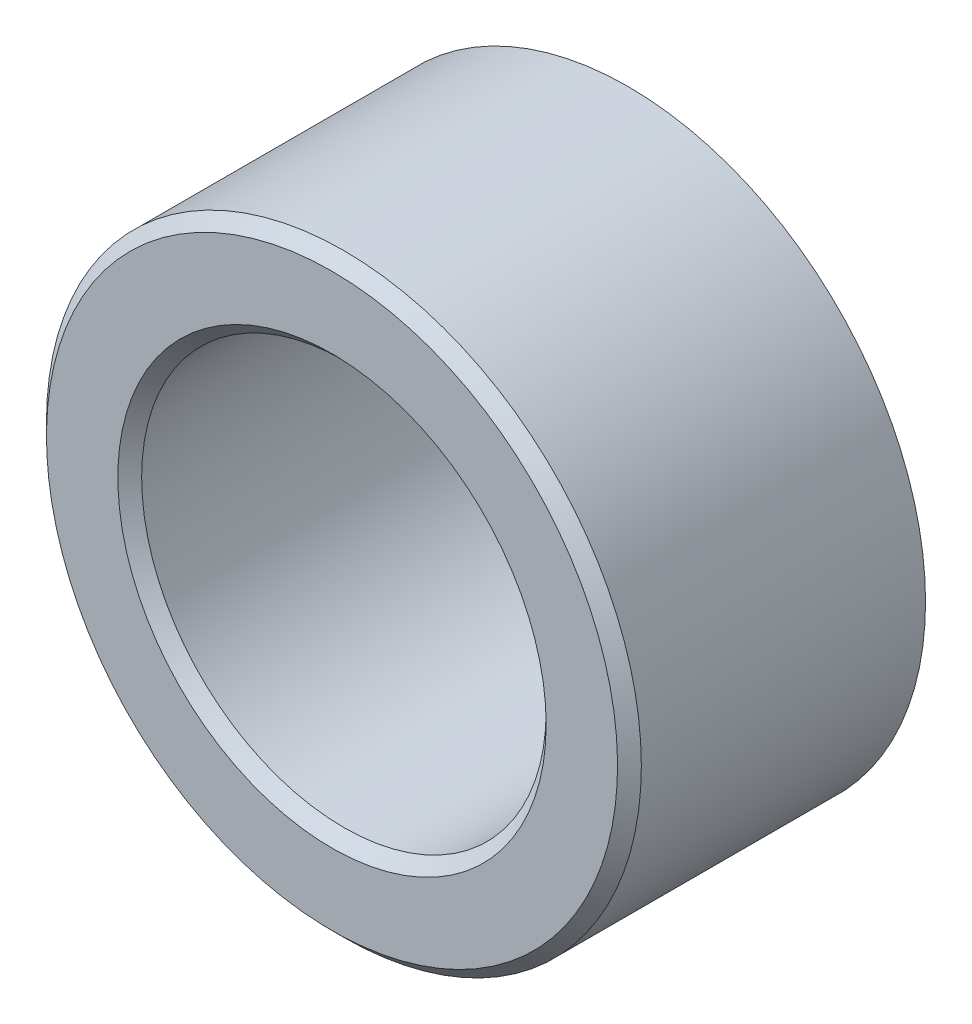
ISO-10303-21;
HEADER;
FILE_DESCRIPTION(('STEP AP214'),'2;1');
FILE_NAME('part.step','',(''),(''),'','','');
FILE_SCHEMA(('AUTOMOTIVE_DESIGN { 1 0 10303 214 1 1 1 1 }'));
ENDSEC;
DATA;
#1=APPLICATION_CONTEXT('core data for automotive mechanical design processes');
#2=APPLICATION_PROTOCOL_DEFINITION('international standard','automotive_design',2000,#1);
#3=PRODUCT_CONTEXT('',#1,'mechanical');
#4=PRODUCT('Part','Part','',(#3));
#5=PRODUCT_RELATED_PRODUCT_CATEGORY('part','',(#4));
#6=PRODUCT_DEFINITION_FORMATION('','',#4);
#7=PRODUCT_DEFINITION_CONTEXT('part definition',#1,'design');
#8=PRODUCT_DEFINITION('design','',#6,#7);
#9=PRODUCT_DEFINITION_SHAPE('','',#8);
#10=(LENGTH_UNIT() NAMED_UNIT(*) SI_UNIT(.MILLI.,.METRE.));
#11=(NAMED_UNIT(*) PLANE_ANGLE_UNIT() SI_UNIT($,.RADIAN.));
#12=(NAMED_UNIT(*) SI_UNIT($,.STERADIAN.) SOLID_ANGLE_UNIT());
#13=UNCERTAINTY_MEASURE_WITH_UNIT(LENGTH_MEASURE(1.E-05),#10,'distance_accuracy_value','');
#14=(GEOMETRIC_REPRESENTATION_CONTEXT(3) GLOBAL_UNCERTAINTY_ASSIGNED_CONTEXT((#13)) GLOBAL_UNIT_ASSIGNED_CONTEXT((#10,
#11,#12)) REPRESENTATION_CONTEXT('',''));
#15=CARTESIAN_POINT('',(0.,0.,0.));
#16=DIRECTION('',(0.,0.,1.));
#17=DIRECTION('',(1.,0.,0.));
#18=AXIS2_PLACEMENT_3D('',#15,#16,#17);
#19=CARTESIAN_POINT('',(0.,0.,0.));
#20=DIRECTION('',(0.,0.,1.));
#21=DIRECTION('',(1.,0.,0.));
#22=AXIS2_PLACEMENT_3D('',#19,#20,#21);
#23=CYLINDRICAL_SURFACE('',#22,6.477);
#24=CARTESIAN_POINT('',(0.,0.,13.2079999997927));
#25=DIRECTION('',(0.,0.,1.));
#26=DIRECTION('',(-1.,0.,0.));
#27=AXIS2_PLACEMENT_3D('',#24,#25,#26);
#28=CIRCLE('',#27,6.47700000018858);
#29=CARTESIAN_POINT('',(-6.47700000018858,0.,13.2079999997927));
#30=VERTEX_POINT('',#29);
#31=EDGE_CURVE('E51',#30,#30,#28,.T.);
#32=ORIENTED_EDGE('',*,*,#31,.T.);
#33=EDGE_LOOP('',(#32));
#34=FACE_BOUND('',#33,.T.);
#35=CARTESIAN_POINT('',(0.,0.,4.10718));
#36=DIRECTION('',(0.,0.,-1.));
#37=DIRECTION('',(-1.,0.,0.));
#38=AXIS2_PLACEMENT_3D('',#35,#36,#37);
#39=CIRCLE('',#38,6.477);
#40=CARTESIAN_POINT('',(-6.477,0.,4.10718));
#41=VERTEX_POINT('',#40);
#42=EDGE_CURVE('E48',#41,#41,#39,.F.);
#43=ORIENTED_EDGE('',*,*,#42,.F.);
#44=EDGE_LOOP('',(#43));
#45=FACE_BOUND('',#44,.T.);
#46=ADVANCED_FACE('F32',(#34,#45),#23,.F.);
#47=CARTESIAN_POINT('',(0.,0.,0.));
#48=DIRECTION('',(0.,0.,1.));
#49=DIRECTION('',(1.,0.,0.));
#50=AXIS2_PLACEMENT_3D('',#47,#48,#49);
#51=CYLINDRICAL_SURFACE('',#50,9.525);
#52=CARTESIAN_POINT('',(0.,0.,13.208));
#53=DIRECTION('',(0.,0.,1.));
#54=DIRECTION('',(1.,0.,0.));
#55=AXIS2_PLACEMENT_3D('',#52,#53,#54);
#56=CIRCLE('',#55,9.525);
#57=CARTESIAN_POINT('',(9.525,0.,13.208));
#58=VERTEX_POINT('',#57);
#59=EDGE_CURVE('E10',#58,#58,#56,.F.);
#60=ORIENTED_EDGE('',*,*,#59,.T.);
#61=EDGE_LOOP('',(#60));
#62=FACE_BOUND('',#61,.T.);
#63=CARTESIAN_POINT('',(0.,0.,4.10718));
#64=DIRECTION('',(0.,0.,-1.));
#65=DIRECTION('',(-1.,0.,0.));
#66=AXIS2_PLACEMENT_3D('',#63,#64,#65);
#67=CIRCLE('',#66,9.525);
#68=CARTESIAN_POINT('',(-9.525,0.,4.10718));
#69=VERTEX_POINT('',#68);
#70=EDGE_CURVE('E35',#69,#69,#67,.F.);
#71=ORIENTED_EDGE('',*,*,#70,.T.);
#72=EDGE_LOOP('',(#71));
#73=FACE_BOUND('',#72,.T.);
#74=ADVANCED_FACE('F72',(#62,#73),#51,.T.);
#75=CARTESIAN_POINT('',(0.,0.,13.589000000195));
#76=DIRECTION('',(0.,0.,1.));
#77=DIRECTION('',(1.,0.,0.));
#78=AXIS2_PLACEMENT_3D('',#75,#76,#77);
#79=CONICAL_SURFACE('',#78,6.85799999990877,0.785398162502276);
#80=CARTESIAN_POINT('',(0.,0.,13.5890000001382));
#81=DIRECTION('',(0.,0.,1.));
#82=DIRECTION('',(1.,0.,0.));
#83=AXIS2_PLACEMENT_3D('',#80,#81,#82);
#84=CIRCLE('',#83,6.85799999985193);
#85=CARTESIAN_POINT('',(6.85799999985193,0.,13.5890000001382));
#86=VERTEX_POINT('',#85);
#87=EDGE_CURVE('E44',#86,#86,#84,.T.);
#88=ORIENTED_EDGE('',*,*,#87,.T.);
#89=EDGE_LOOP('',(#88));
#90=FACE_BOUND('',#89,.T.);
#91=ORIENTED_EDGE('',*,*,#31,.F.);
#92=EDGE_LOOP('',(#91));
#93=FACE_BOUND('',#92,.T.);
#94=ADVANCED_FACE('F58',(#90,#93),#79,.F.);
#95=CARTESIAN_POINT('',(0.,0.,13.589));
#96=DIRECTION('',(0.,0.,-1.));
#97=DIRECTION('',(-1.,0.,0.));
#98=AXIS2_PLACEMENT_3D('',#95,#96,#97);
#99=PLANE('',#98);
#100=ORIENTED_EDGE('',*,*,#87,.F.);
#101=EDGE_LOOP('',(#100));
#102=FACE_BOUND('',#101,.T.);
#103=CARTESIAN_POINT('',(0.,0.,13.589000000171));
#104=DIRECTION('',(0.,0.,-1.));
#105=DIRECTION('',(0.,1.,0.));
#106=AXIS2_PLACEMENT_3D('',#103,#104,#105);
#107=CIRCLE('',#106,9.14400000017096);
#108=CARTESIAN_POINT('',(0.,9.14400000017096,13.589000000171));
#109=VERTEX_POINT('',#108);
#110=EDGE_CURVE('E39',#109,#109,#107,.T.);
#111=ORIENTED_EDGE('',*,*,#110,.F.);
#112=EDGE_LOOP('',(#111));
#113=FACE_BOUND('',#112,.T.);
#114=ADVANCED_FACE('F61',(#102,#113),#99,.F.);
#115=CARTESIAN_POINT('',(0.,0.,13.207999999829));
#116=DIRECTION('',(0.,0.,-1.));
#117=DIRECTION('',(0.,1.,0.));
#118=AXIS2_PLACEMENT_3D('',#115,#116,#117);
#119=CONICAL_SURFACE('',#118,9.52499999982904,0.7853981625);
#120=ORIENTED_EDGE('',*,*,#59,.F.);
#121=EDGE_LOOP('',(#120));
#122=FACE_BOUND('',#121,.T.);
#123=ORIENTED_EDGE('',*,*,#110,.T.);
#124=EDGE_LOOP('',(#123));
#125=FACE_BOUND('',#124,.T.);
#126=ADVANCED_FACE('F64',(#122,#125),#119,.T.);
#127=CARTESIAN_POINT('',(0.,0.,4.10718));
#128=DIRECTION('',(0.,0.,-1.));
#129=DIRECTION('',(-1.,0.,0.));
#130=AXIS2_PLACEMENT_3D('',#127,#128,#129);
#131=PLANE('',#130);
#132=ORIENTED_EDGE('',*,*,#70,.F.);
#133=EDGE_LOOP('',(#132));
#134=FACE_BOUND('',#133,.T.);
#135=ORIENTED_EDGE('',*,*,#42,.T.);
#136=EDGE_LOOP('',(#135));
#137=FACE_BOUND('',#136,.T.);
#138=ADVANCED_FACE('F69',(#134,#137),#131,.T.);
#139=CLOSED_SHELL('',(#46,#74,#94,#114,#126,#138));
#140=MANIFOLD_SOLID_BREP('B2',#139);
#141=ADVANCED_BREP_SHAPE_REPRESENTATION('',(#18,#140),#14);
#142=SHAPE_DEFINITION_REPRESENTATION(#9,#141);
ENDSEC;
END-ISO-10303-21;
